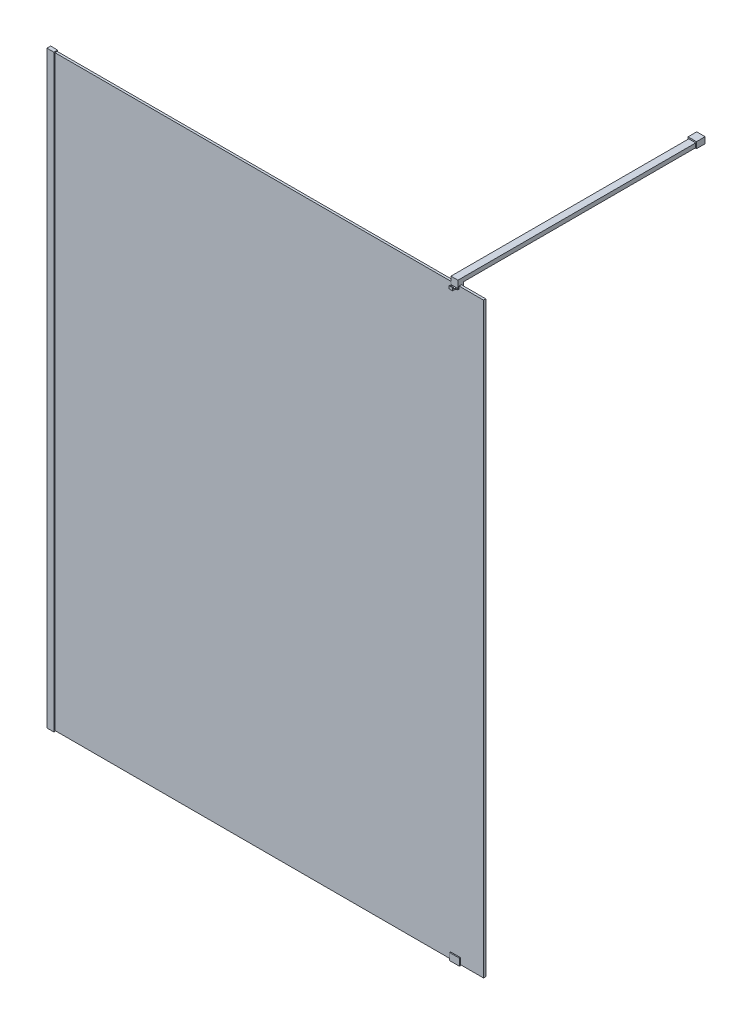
ISO-10303-21;
HEADER;
FILE_DESCRIPTION(('STEP AP214'),'2;1');
FILE_NAME('part.step','',(''),(''),'','','');
FILE_SCHEMA(('AUTOMOTIVE_DESIGN { 1 0 10303 214 1 1 1 1 }'));
ENDSEC;
DATA;
#1=APPLICATION_CONTEXT('core data for automotive mechanical design processes');
#2=APPLICATION_PROTOCOL_DEFINITION('international standard','automotive_design',2000,#1);
#3=PRODUCT_CONTEXT('',#1,'mechanical');
#4=PRODUCT('Part','Part','',(#3));
#5=PRODUCT_RELATED_PRODUCT_CATEGORY('part','',(#4));
#6=PRODUCT_DEFINITION_FORMATION('','',#4);
#7=PRODUCT_DEFINITION_CONTEXT('part definition',#1,'design');
#8=PRODUCT_DEFINITION('design','',#6,#7);
#9=PRODUCT_DEFINITION_SHAPE('','',#8);
#10=(LENGTH_UNIT() NAMED_UNIT(*) SI_UNIT(.MILLI.,.METRE.));
#11=(NAMED_UNIT(*) PLANE_ANGLE_UNIT() SI_UNIT($,.RADIAN.));
#12=(NAMED_UNIT(*) SI_UNIT($,.STERADIAN.) SOLID_ANGLE_UNIT());
#13=UNCERTAINTY_MEASURE_WITH_UNIT(LENGTH_MEASURE(1.E-05),#10,'distance_accuracy_value','');
#14=(GEOMETRIC_REPRESENTATION_CONTEXT(3) GLOBAL_UNCERTAINTY_ASSIGNED_CONTEXT((#13)) GLOBAL_UNIT_ASSIGNED_CONTEXT((#10,
#11,#12)) REPRESENTATION_CONTEXT('',''));
#15=CARTESIAN_POINT('',(0.,0.,0.));
#16=DIRECTION('',(0.,0.,1.));
#17=DIRECTION('',(1.,0.,0.));
#18=AXIS2_PLACEMENT_3D('',#15,#16,#17);
#19=CARTESIAN_POINT('',(1470.95,2090.,-19.4000000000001));
#20=DIRECTION('',(-1.,0.,0.));
#21=DIRECTION('',(0.,0.,1.));
#22=AXIS2_PLACEMENT_3D('',#19,#20,#21);
#23=PLANE('',#22);
#24=DIRECTION('',(0.,-1.,0.));
#25=VECTOR('',#24,1.);
#26=CARTESIAN_POINT('',(1470.95,2090.,-850.03));
#27=LINE('',#26,#25);
#28=CARTESIAN_POINT('',(1470.95,2120.,-850.03));
#29=VERTEX_POINT('',#28);
#30=CARTESIAN_POINT('',(1470.95,2105.,-850.03));
#31=VERTEX_POINT('',#30);
#32=EDGE_CURVE('E61',#29,#31,#27,.T.);
#33=ORIENTED_EDGE('',*,*,#32,.F.);
#34=DIRECTION('',(0.,0.,1.));
#35=VECTOR('',#34,1.);
#36=CARTESIAN_POINT('',(1470.95,2120.,0.599999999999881));
#37=LINE('',#36,#35);
#38=CARTESIAN_POINT('',(1470.95,2120.,0.599999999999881));
#39=VERTEX_POINT('',#38);
#40=EDGE_CURVE('E386',#29,#39,#37,.T.);
#41=ORIENTED_EDGE('',*,*,#40,.T.);
#42=DIRECTION('',(0.,-1.,0.));
#43=VECTOR('',#42,1.);
#44=CARTESIAN_POINT('',(1470.95,2094.,0.599999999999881));
#45=LINE('',#44,#43);
#46=CARTESIAN_POINT('',(1470.95,2094.,0.599999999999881));
#47=VERTEX_POINT('',#46);
#48=EDGE_CURVE('E388',#39,#47,#45,.T.);
#49=ORIENTED_EDGE('',*,*,#48,.T.);
#50=DIRECTION('',(0.,1.,0.));
#51=VECTOR('',#50,1.);
#52=CARTESIAN_POINT('',(1470.95,2090.,0.599999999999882));
#53=LINE('',#52,#51);
#54=CARTESIAN_POINT('',(1470.95,2090.,0.599999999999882));
#55=VERTEX_POINT('',#54);
#56=EDGE_CURVE('E332',#55,#47,#53,.T.);
#57=ORIENTED_EDGE('',*,*,#56,.F.);
#58=DIRECTION('',(0.,0.,-1.));
#59=VECTOR('',#58,1.);
#60=CARTESIAN_POINT('',(1470.95,2090.,-3.40000000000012));
#61=LINE('',#60,#59);
#62=CARTESIAN_POINT('',(1470.95,2090.,-3.40000000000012));
#63=VERTEX_POINT('',#62);
#64=EDGE_CURVE('E362',#55,#63,#61,.T.);
#65=ORIENTED_EDGE('',*,*,#64,.T.);
#66=DIRECTION('',(0.,1.,-1.30407837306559E-13));
#67=VECTOR('',#66,1.);
#68=CARTESIAN_POINT('',(1470.95,2100.,-3.40000000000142));
#69=LINE('',#68,#67);
#70=CARTESIAN_POINT('',(1470.95,2100.,-3.40000000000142));
#71=VERTEX_POINT('',#70);
#72=EDGE_CURVE('E392',#63,#71,#69,.T.);
#73=ORIENTED_EDGE('',*,*,#72,.T.);
#74=DIRECTION('',(0.,0.,-1.));
#75=VECTOR('',#74,1.);
#76=CARTESIAN_POINT('',(1470.95,2100.,-11.4000000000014));
#77=LINE('',#76,#75);
#78=CARTESIAN_POINT('',(1470.95,2100.,-11.4000000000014));
#79=VERTEX_POINT('',#78);
#80=EDGE_CURVE('E394',#71,#79,#77,.T.);
#81=ORIENTED_EDGE('',*,*,#80,.T.);
#82=DIRECTION('',(0.,-1.,1.30451205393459E-13));
#83=VECTOR('',#82,1.);
#84=CARTESIAN_POINT('',(1470.95,2090.,-11.4000000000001));
#85=LINE('',#84,#83);
#86=CARTESIAN_POINT('',(1470.95,2090.,-11.4000000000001));
#87=VERTEX_POINT('',#86);
#88=EDGE_CURVE('E395',#79,#87,#85,.T.);
#89=ORIENTED_EDGE('',*,*,#88,.T.);
#90=DIRECTION('',(0.,0.,-1.));
#91=VECTOR('',#90,1.);
#92=CARTESIAN_POINT('',(1470.95,2090.,-19.4000000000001));
#93=LINE('',#92,#91);
#94=CARTESIAN_POINT('',(1470.95,2090.,-19.4000000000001));
#95=VERTEX_POINT('',#94);
#96=EDGE_CURVE('E283',#87,#95,#93,.T.);
#97=ORIENTED_EDGE('',*,*,#96,.T.);
#98=DIRECTION('',(0.,1.,0.));
#99=VECTOR('',#98,1.);
#100=CARTESIAN_POINT('',(1470.95,2120.,-19.4000000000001));
#101=LINE('',#100,#99);
#102=CARTESIAN_POINT('',(1470.95,2105.,-19.4000000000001));
#103=VERTEX_POINT('',#102);
#104=EDGE_CURVE('E249',#95,#103,#101,.T.);
#105=ORIENTED_EDGE('',*,*,#104,.T.);
#106=DIRECTION('',(0.,0.,-1.));
#107=VECTOR('',#106,1.);
#108=CARTESIAN_POINT('',(1470.95,2105.,-881.03));
#109=LINE('',#108,#107);
#110=EDGE_CURVE('E248',#103,#31,#109,.T.);
#111=ORIENTED_EDGE('',*,*,#110,.T.);
#112=EDGE_LOOP('',(#33,#41,#49,#57,#65,#73,#81,#89,#97,#105,#111));
#113=FACE_BOUND('',#112,.T.);
#114=ADVANCED_FACE('F46',(#113),#23,.F.);
#115=CARTESIAN_POINT('',(1445.95,2090.,-19.4000000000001));
#116=DIRECTION('',(-1.,0.,0.));
#117=DIRECTION('',(0.,0.,1.));
#118=AXIS2_PLACEMENT_3D('',#115,#116,#117);
#119=PLANE('',#118);
#120=DIRECTION('',(0.,0.,1.));
#121=VECTOR('',#120,1.);
#122=CARTESIAN_POINT('',(1445.95,2120.,0.599999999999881));
#123=LINE('',#122,#121);
#124=CARTESIAN_POINT('',(1445.95,2120.,-850.03));
#125=VERTEX_POINT('',#124);
#126=CARTESIAN_POINT('',(1445.95,2120.,0.599999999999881));
#127=VERTEX_POINT('',#126);
#128=EDGE_CURVE('E272',#125,#127,#123,.T.);
#129=ORIENTED_EDGE('',*,*,#128,.F.);
#130=DIRECTION('',(0.,-1.,0.));
#131=VECTOR('',#130,1.);
#132=CARTESIAN_POINT('',(1445.95,2090.,-850.03));
#133=LINE('',#132,#131);
#134=CARTESIAN_POINT('',(1445.95,2105.,-850.03));
#135=VERTEX_POINT('',#134);
#136=EDGE_CURVE('E230',#125,#135,#133,.T.);
#137=ORIENTED_EDGE('',*,*,#136,.T.);
#138=DIRECTION('',(0.,0.,1.));
#139=VECTOR('',#138,1.);
#140=CARTESIAN_POINT('',(1445.95,2105.,-881.03));
#141=LINE('',#140,#139);
#142=CARTESIAN_POINT('',(1445.95,2105.,-19.4000000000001));
#143=VERTEX_POINT('',#142);
#144=EDGE_CURVE('E238',#135,#143,#141,.T.);
#145=ORIENTED_EDGE('',*,*,#144,.T.);
#146=DIRECTION('',(0.,1.,0.));
#147=VECTOR('',#146,1.);
#148=CARTESIAN_POINT('',(1445.95,2120.,-19.4000000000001));
#149=LINE('',#148,#147);
#150=CARTESIAN_POINT('',(1445.95,2090.,-19.4000000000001));
#151=VERTEX_POINT('',#150);
#152=EDGE_CURVE('E262',#151,#143,#149,.T.);
#153=ORIENTED_EDGE('',*,*,#152,.F.);
#154=DIRECTION('',(0.,0.,-1.));
#155=VECTOR('',#154,1.);
#156=CARTESIAN_POINT('',(1445.95,2090.,-19.4000000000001));
#157=LINE('',#156,#155);
#158=CARTESIAN_POINT('',(1445.95,2090.,-11.4000000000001));
#159=VERTEX_POINT('',#158);
#160=EDGE_CURVE('E296',#159,#151,#157,.T.);
#161=ORIENTED_EDGE('',*,*,#160,.F.);
#162=DIRECTION('',(0.,-1.,1.30451205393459E-13));
#163=VECTOR('',#162,1.);
#164=CARTESIAN_POINT('',(1445.95,2090.,-11.4000000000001));
#165=LINE('',#164,#163);
#166=CARTESIAN_POINT('',(1445.95,2100.,-11.4000000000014));
#167=VERTEX_POINT('',#166);
#168=EDGE_CURVE('E294',#167,#159,#165,.T.);
#169=ORIENTED_EDGE('',*,*,#168,.F.);
#170=DIRECTION('',(0.,0.,-1.));
#171=VECTOR('',#170,1.);
#172=CARTESIAN_POINT('',(1445.95,2100.,-11.4000000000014));
#173=LINE('',#172,#171);
#174=CARTESIAN_POINT('',(1445.95,2100.,-3.40000000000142));
#175=VERTEX_POINT('',#174);
#176=EDGE_CURVE('E292',#175,#167,#173,.T.);
#177=ORIENTED_EDGE('',*,*,#176,.F.);
#178=DIRECTION('',(0.,1.,-1.30407837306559E-13));
#179=VECTOR('',#178,1.);
#180=CARTESIAN_POINT('',(1445.95,2100.,-3.40000000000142));
#181=LINE('',#180,#179);
#182=CARTESIAN_POINT('',(1445.95,2090.,-3.40000000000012));
#183=VERTEX_POINT('',#182);
#184=EDGE_CURVE('E290',#183,#175,#181,.T.);
#185=ORIENTED_EDGE('',*,*,#184,.F.);
#186=DIRECTION('',(0.,0.,-1.));
#187=VECTOR('',#186,1.);
#188=CARTESIAN_POINT('',(1445.95,2090.,-3.40000000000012));
#189=LINE('',#188,#187);
#190=CARTESIAN_POINT('',(1445.95,2090.,0.599999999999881));
#191=VERTEX_POINT('',#190);
#192=EDGE_CURVE('E288',#191,#183,#189,.T.);
#193=ORIENTED_EDGE('',*,*,#192,.F.);
#194=DIRECTION('',(0.,1.,0.));
#195=VECTOR('',#194,1.);
#196=CARTESIAN_POINT('',(1445.95,2090.,0.599999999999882));
#197=LINE('',#196,#195);
#198=CARTESIAN_POINT('',(1445.95,2094.,0.599999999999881));
#199=VERTEX_POINT('',#198);
#200=EDGE_CURVE('E329',#191,#199,#197,.T.);
#201=ORIENTED_EDGE('',*,*,#200,.T.);
#202=DIRECTION('',(0.,-1.,0.));
#203=VECTOR('',#202,1.);
#204=CARTESIAN_POINT('',(1445.95,2094.,0.599999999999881));
#205=LINE('',#204,#203);
#206=EDGE_CURVE('E274',#127,#199,#205,.T.);
#207=ORIENTED_EDGE('',*,*,#206,.F.);
#208=EDGE_LOOP('',(#129,#137,#145,#153,#161,#169,#177,#185,#193,#201,#207));
#209=FACE_BOUND('',#208,.T.);
#210=ADVANCED_FACE('F259',(#209),#119,.T.);
#211=CARTESIAN_POINT('',(1470.95,2120.,0.599999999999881));
#212=DIRECTION('',(0.,-1.,0.));
#213=DIRECTION('',(0.,0.,-1.));
#214=AXIS2_PLACEMENT_3D('',#211,#212,#213);
#215=PLANE('',#214);
#216=DIRECTION('',(1.,0.,0.));
#217=VECTOR('',#216,1.);
#218=CARTESIAN_POINT('',(1470.95,2120.,-850.03));
#219=LINE('',#218,#217);
#220=EDGE_CURVE('E68',#125,#29,#219,.T.);
#221=ORIENTED_EDGE('',*,*,#220,.F.);
#222=ORIENTED_EDGE('',*,*,#128,.T.);
#223=DIRECTION('',(-1.,0.,0.));
#224=VECTOR('',#223,1.);
#225=CARTESIAN_POINT('',(1470.95,2120.,0.599999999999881));
#226=LINE('',#225,#224);
#227=EDGE_CURVE('E326',#39,#127,#226,.T.);
#228=ORIENTED_EDGE('',*,*,#227,.F.);
#229=ORIENTED_EDGE('',*,*,#40,.F.);
#230=EDGE_LOOP('',(#221,#222,#228,#229));
#231=FACE_BOUND('',#230,.T.);
#232=ADVANCED_FACE('F437',(#231),#215,.F.);
#233=CARTESIAN_POINT('',(1445.95,2105.,-19.4000000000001));
#234=DIRECTION('',(0.,1.,0.));
#235=DIRECTION('',(0.,0.,1.));
#236=AXIS2_PLACEMENT_3D('',#233,#234,#235);
#237=PLANE('',#236);
#238=DIRECTION('',(-1.,0.,0.));
#239=VECTOR('',#238,1.);
#240=CARTESIAN_POINT('',(1445.95,2105.,-850.03));
#241=LINE('',#240,#239);
#242=EDGE_CURVE('E12',#31,#135,#241,.T.);
#243=ORIENTED_EDGE('',*,*,#242,.F.);
#244=ORIENTED_EDGE('',*,*,#110,.F.);
#245=DIRECTION('',(1.,0.,0.));
#246=VECTOR('',#245,1.);
#247=CARTESIAN_POINT('',(1445.95,2105.,-19.4000000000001));
#248=LINE('',#247,#246);
#249=EDGE_CURVE('E244',#143,#103,#248,.T.);
#250=ORIENTED_EDGE('',*,*,#249,.F.);
#251=ORIENTED_EDGE('',*,*,#144,.F.);
#252=EDGE_LOOP('',(#243,#244,#250,#251));
#253=FACE_BOUND('',#252,.T.);
#254=ADVANCED_FACE('F265',(#253),#237,.F.);
#255=CARTESIAN_POINT('',(1470.95,2094.,9.84506801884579));
#256=DIRECTION('',(0.,-1.,0.));
#257=DIRECTION('',(0.,0.,-1.));
#258=AXIS2_PLACEMENT_3D('',#255,#256,#257);
#259=PLANE('',#258);
#260=DIRECTION('',(-0.906307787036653,0.,-0.422618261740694));
#261=VECTOR('',#260,1.);
#262=CARTESIAN_POINT('',(1470.02591161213,2094.,11.8267819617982));
#263=LINE('',#262,#261);
#264=CARTESIAN_POINT('',(1452.45,2094.,3.6309997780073));
#265=VERTEX_POINT('',#264);
#266=EDGE_CURVE('E365',#265,#199,#263,.T.);
#267=ORIENTED_EDGE('',*,*,#266,.F.);
#268=DIRECTION('',(0.,0.,-1.));
#269=VECTOR('',#268,1.);
#270=CARTESIAN_POINT('',(1452.45,2094.,9.84506801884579));
#271=LINE('',#270,#269);
#272=CARTESIAN_POINT('',(1452.45,2094.,9.84506801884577));
#273=VERTEX_POINT('',#272);
#274=EDGE_CURVE('E273',#273,#265,#271,.T.);
#275=ORIENTED_EDGE('',*,*,#274,.F.);
#276=DIRECTION('',(-1.,0.,0.));
#277=VECTOR('',#276,1.);
#278=CARTESIAN_POINT('',(1470.95,2094.,9.84506801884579));
#279=LINE('',#278,#277);
#280=CARTESIAN_POINT('',(1464.45,2094.,9.84506801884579));
#281=VERTEX_POINT('',#280);
#282=EDGE_CURVE('E320',#281,#273,#279,.T.);
#283=ORIENTED_EDGE('',*,*,#282,.F.);
#284=DIRECTION('',(0.,0.,1.));
#285=VECTOR('',#284,1.);
#286=CARTESIAN_POINT('',(1464.45,2094.,9.84506801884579));
#287=LINE('',#286,#285);
#288=CARTESIAN_POINT('',(1464.45,2094.,3.63099977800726));
#289=VERTEX_POINT('',#288);
#290=EDGE_CURVE('E379',#289,#281,#287,.T.);
#291=ORIENTED_EDGE('',*,*,#290,.F.);
#292=DIRECTION('',(-0.906307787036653,0.,0.422618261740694));
#293=VECTOR('',#292,1.);
#294=CARTESIAN_POINT('',(1467.40893350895,2094.,2.25122642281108));
#295=LINE('',#294,#293);
#296=EDGE_CURVE('E364',#47,#289,#295,.T.);
#297=ORIENTED_EDGE('',*,*,#296,.F.);
#298=DIRECTION('',(-1.,0.,0.));
#299=VECTOR('',#298,1.);
#300=CARTESIAN_POINT('',(1470.95,2094.,0.599999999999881));
#301=LINE('',#300,#299);
#302=EDGE_CURVE('E323',#47,#199,#301,.T.);
#303=ORIENTED_EDGE('',*,*,#302,.T.);
#304=EDGE_LOOP('',(#267,#275,#283,#291,#297,#303));
#305=FACE_BOUND('',#304,.T.);
#306=ADVANCED_FACE('F424',(#305),#259,.F.);
#307=CARTESIAN_POINT('',(1470.95,2100.,10.3700000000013));
#308=DIRECTION('',(0.,-0.087155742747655,0.996194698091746));
#309=DIRECTION('',(0.,-0.996194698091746,-0.087155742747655));
#310=AXIS2_PLACEMENT_3D('',#307,#308,#309);
#311=PLANE('',#310);
#312=DIRECTION('',(0.,-0.996194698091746,-0.087155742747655));
#313=VECTOR('',#312,1.);
#314=CARTESIAN_POINT('',(1452.45,2100.,10.3700000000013));
#315=LINE('',#314,#313);
#316=CARTESIAN_POINT('',(1452.45,2100.,10.3700000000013));
#317=VERTEX_POINT('',#316);
#318=EDGE_CURVE('E276',#317,#273,#315,.T.);
#319=ORIENTED_EDGE('',*,*,#318,.F.);
#320=DIRECTION('',(-1.,0.,0.));
#321=VECTOR('',#320,1.);
#322=CARTESIAN_POINT('',(1470.95,2100.,10.3700000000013));
#323=LINE('',#322,#321);
#324=CARTESIAN_POINT('',(1464.45,2100.,10.3700000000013));
#325=VERTEX_POINT('',#324);
#326=EDGE_CURVE('E317',#325,#317,#323,.T.);
#327=ORIENTED_EDGE('',*,*,#326,.F.);
#328=DIRECTION('',(0.,0.996194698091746,0.087155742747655));
#329=VECTOR('',#328,1.);
#330=CARTESIAN_POINT('',(1464.45,2100.,10.3700000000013));
#331=LINE('',#330,#329);
#332=EDGE_CURVE('E376',#281,#325,#331,.T.);
#333=ORIENTED_EDGE('',*,*,#332,.F.);
#334=ORIENTED_EDGE('',*,*,#282,.T.);
#335=EDGE_LOOP('',(#319,#327,#333,#334));
#336=FACE_BOUND('',#335,.T.);
#337=ADVANCED_FACE('F428',(#336),#311,.F.);
#338=CARTESIAN_POINT('',(1470.95,2100.,13.3700000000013));
#339=DIRECTION('',(0.,-1.,1.48029736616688E-13));
#340=DIRECTION('',(0.,-1.48029736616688E-13,-1.));
#341=AXIS2_PLACEMENT_3D('',#338,#339,#340);
#342=PLANE('',#341);
#343=DIRECTION('',(0.,-1.48029736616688E-13,-1.));
#344=VECTOR('',#343,1.);
#345=CARTESIAN_POINT('',(1452.45,2100.,13.3700000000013));
#346=LINE('',#345,#344);
#347=CARTESIAN_POINT('',(1452.45,2100.,13.3700000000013));
#348=VERTEX_POINT('',#347);
#349=EDGE_CURVE('E382',#348,#317,#346,.T.);
#350=ORIENTED_EDGE('',*,*,#349,.F.);
#351=DIRECTION('',(-1.,0.,0.));
#352=VECTOR('',#351,1.);
#353=CARTESIAN_POINT('',(1470.95,2100.,13.3700000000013));
#354=LINE('',#353,#352);
#355=CARTESIAN_POINT('',(1464.45,2100.,13.3700000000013));
#356=VERTEX_POINT('',#355);
#357=EDGE_CURVE('E314',#356,#348,#354,.T.);
#358=ORIENTED_EDGE('',*,*,#357,.F.);
#359=DIRECTION('',(0.,1.48029736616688E-13,1.));
#360=VECTOR('',#359,1.);
#361=CARTESIAN_POINT('',(1464.45,2100.,13.3700000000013));
#362=LINE('',#361,#360);
#363=EDGE_CURVE('E368',#325,#356,#362,.T.);
#364=ORIENTED_EDGE('',*,*,#363,.F.);
#365=ORIENTED_EDGE('',*,*,#326,.T.);
#366=EDGE_LOOP('',(#350,#358,#364,#365));
#367=FACE_BOUND('',#366,.T.);
#368=ADVANCED_FACE('F431',(#367),#342,.F.);
#369=CARTESIAN_POINT('',(1470.95,2090.,13.3700000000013));
#370=DIRECTION('',(0.,0.,-1.));
#371=DIRECTION('',(0.,1.,0.));
#372=AXIS2_PLACEMENT_3D('',#369,#370,#371);
#373=PLANE('',#372);
#374=ORIENTED_EDGE('',*,*,#357,.T.);
#375=DIRECTION('',(0.,-1.,0.));
#376=VECTOR('',#375,1.);
#377=CARTESIAN_POINT('',(1452.45,8021.01585998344,13.3700000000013));
#378=LINE('',#377,#376);
#379=CARTESIAN_POINT('',(1452.45,2090.,13.3700000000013));
#380=VERTEX_POINT('',#379);
#381=EDGE_CURVE('E345',#348,#380,#378,.T.);
#382=ORIENTED_EDGE('',*,*,#381,.T.);
#383=DIRECTION('',(-1.,0.,0.));
#384=VECTOR('',#383,1.);
#385=CARTESIAN_POINT('',(1470.95,2090.,13.3700000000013));
#386=LINE('',#385,#384);
#387=CARTESIAN_POINT('',(1464.45,2090.,13.3700000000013));
#388=VERTEX_POINT('',#387);
#389=EDGE_CURVE('E311',#388,#380,#386,.T.);
#390=ORIENTED_EDGE('',*,*,#389,.F.);
#391=DIRECTION('',(0.,-1.,0.));
#392=VECTOR('',#391,1.);
#393=CARTESIAN_POINT('',(1464.45,8021.01585998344,13.3700000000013));
#394=LINE('',#393,#392);
#395=EDGE_CURVE('E355',#356,#388,#394,.T.);
#396=ORIENTED_EDGE('',*,*,#395,.F.);
#397=EDGE_LOOP('',(#374,#382,#390,#396));
#398=FACE_BOUND('',#397,.T.);
#399=ADVANCED_FACE('F353',(#398),#373,.F.);
#400=CARTESIAN_POINT('',(1470.95,2090.,-3.40000000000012));
#401=DIRECTION('',(0.,1.,0.));
#402=DIRECTION('',(0.,0.,1.));
#403=AXIS2_PLACEMENT_3D('',#400,#401,#402);
#404=PLANE('',#403);
#405=DIRECTION('',(0.906307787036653,0.,0.422618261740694));
#406=VECTOR('',#405,1.);
#407=CARTESIAN_POINT('',(1464.95275623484,2090.,9.46113075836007));
#408=LINE('',#407,#406);
#409=CARTESIAN_POINT('',(1452.45,2090.,3.6309997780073));
#410=VERTEX_POINT('',#409);
#411=EDGE_CURVE('E370',#191,#410,#408,.T.);
#412=ORIENTED_EDGE('',*,*,#411,.F.);
#413=ORIENTED_EDGE('',*,*,#192,.T.);
#414=DIRECTION('',(-1.,0.,0.));
#415=VECTOR('',#414,1.);
#416=CARTESIAN_POINT('',(1470.95,2090.,-3.40000000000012));
#417=LINE('',#416,#415);
#418=EDGE_CURVE('E308',#63,#183,#417,.T.);
#419=ORIENTED_EDGE('',*,*,#418,.F.);
#420=ORIENTED_EDGE('',*,*,#64,.F.);
#421=DIRECTION('',(0.906307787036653,0.,-0.422618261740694));
#422=VECTOR('',#421,1.);
#423=CARTESIAN_POINT('',(1472.48208888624,2090.,-0.114424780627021));
#424=LINE('',#423,#422);
#425=CARTESIAN_POINT('',(1464.45,2090.,3.6309997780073));
#426=VERTEX_POINT('',#425);
#427=EDGE_CURVE('E360',#426,#55,#424,.T.);
#428=ORIENTED_EDGE('',*,*,#427,.F.);
#429=DIRECTION('',(0.,0.,-1.));
#430=VECTOR('',#429,1.);
#431=CARTESIAN_POINT('',(1464.45,2090.,-3.40000000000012));
#432=LINE('',#431,#430);
#433=EDGE_CURVE('E334',#388,#426,#432,.T.);
#434=ORIENTED_EDGE('',*,*,#433,.F.);
#435=ORIENTED_EDGE('',*,*,#389,.T.);
#436=DIRECTION('',(0.,0.,1.));
#437=VECTOR('',#436,1.);
#438=CARTESIAN_POINT('',(1452.45,2090.,-3.40000000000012));
#439=LINE('',#438,#437);
#440=EDGE_CURVE('E54',#410,#380,#439,.T.);
#441=ORIENTED_EDGE('',*,*,#440,.F.);
#442=EDGE_LOOP('',(#412,#413,#419,#420,#428,#434,#435,#441));
#443=FACE_BOUND('',#442,.T.);
#444=ADVANCED_FACE('F357',(#443),#404,.F.);
#445=CARTESIAN_POINT('',(1470.95,2120.,-19.4000000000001));
#446=DIRECTION('',(0.,0.,1.));
#447=DIRECTION('',(0.,-1.,0.));
#448=AXIS2_PLACEMENT_3D('',#445,#446,#447);
#449=PLANE('',#448);
#450=ORIENTED_EDGE('',*,*,#152,.T.);
#451=ORIENTED_EDGE('',*,*,#249,.T.);
#452=ORIENTED_EDGE('',*,*,#104,.F.);
#453=DIRECTION('',(-1.,0.,0.));
#454=VECTOR('',#453,1.);
#455=CARTESIAN_POINT('',(1470.95,2090.,-19.4000000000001));
#456=LINE('',#455,#454);
#457=EDGE_CURVE('E271',#95,#151,#456,.T.);
#458=ORIENTED_EDGE('',*,*,#457,.T.);
#459=EDGE_LOOP('',(#450,#451,#452,#458));
#460=FACE_BOUND('',#459,.T.);
#461=ADVANCED_FACE('F48',(#460),#449,.F.);
#462=CARTESIAN_POINT('',(1470.95,2094.,0.599999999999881));
#463=DIRECTION('',(0.,0.,-1.));
#464=DIRECTION('',(0.,1.,0.));
#465=AXIS2_PLACEMENT_3D('',#462,#463,#464);
#466=PLANE('',#465);
#467=ORIENTED_EDGE('',*,*,#206,.T.);
#468=ORIENTED_EDGE('',*,*,#302,.F.);
#469=ORIENTED_EDGE('',*,*,#48,.F.);
#470=ORIENTED_EDGE('',*,*,#227,.T.);
#471=EDGE_LOOP('',(#467,#468,#469,#470));
#472=FACE_BOUND('',#471,.T.);
#473=ADVANCED_FACE('F435',(#472),#466,.F.);
#474=CARTESIAN_POINT('',(1470.95,2100.,-3.40000000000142));
#475=DIRECTION('',(0.,1.30407837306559E-13,1.));
#476=DIRECTION('',(0.,-1.,1.30407837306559E-13));
#477=AXIS2_PLACEMENT_3D('',#474,#475,#476);
#478=PLANE('',#477);
#479=ORIENTED_EDGE('',*,*,#184,.T.);
#480=DIRECTION('',(-1.,0.,0.));
#481=VECTOR('',#480,1.);
#482=CARTESIAN_POINT('',(1470.95,2100.,-3.40000000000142));
#483=LINE('',#482,#481);
#484=EDGE_CURVE('E305',#71,#175,#483,.T.);
#485=ORIENTED_EDGE('',*,*,#484,.F.);
#486=ORIENTED_EDGE('',*,*,#72,.F.);
#487=ORIENTED_EDGE('',*,*,#418,.T.);
#488=EDGE_LOOP('',(#479,#485,#486,#487));
#489=FACE_BOUND('',#488,.T.);
#490=ADVANCED_FACE('F413',(#489),#478,.F.);
#491=CARTESIAN_POINT('',(1470.95,2100.,-11.4000000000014));
#492=DIRECTION('',(0.,1.,0.));
#493=DIRECTION('',(0.,0.,1.));
#494=AXIS2_PLACEMENT_3D('',#491,#492,#493);
#495=PLANE('',#494);
#496=ORIENTED_EDGE('',*,*,#176,.T.);
#497=DIRECTION('',(-1.,0.,0.));
#498=VECTOR('',#497,1.);
#499=CARTESIAN_POINT('',(1470.95,2100.,-11.4000000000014));
#500=LINE('',#499,#498);
#501=EDGE_CURVE('E302',#79,#167,#500,.T.);
#502=ORIENTED_EDGE('',*,*,#501,.F.);
#503=ORIENTED_EDGE('',*,*,#80,.F.);
#504=ORIENTED_EDGE('',*,*,#484,.T.);
#505=EDGE_LOOP('',(#496,#502,#503,#504));
#506=FACE_BOUND('',#505,.T.);
#507=ADVANCED_FACE('F409',(#506),#495,.F.);
#508=CARTESIAN_POINT('',(1470.95,2090.,-11.4000000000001));
#509=DIRECTION('',(0.,-1.30451205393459E-13,-1.));
#510=DIRECTION('',(0.,1.,-1.30451205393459E-13));
#511=AXIS2_PLACEMENT_3D('',#508,#509,#510);
#512=PLANE('',#511);
#513=ORIENTED_EDGE('',*,*,#168,.T.);
#514=DIRECTION('',(-1.,0.,0.));
#515=VECTOR('',#514,1.);
#516=CARTESIAN_POINT('',(1470.95,2090.,-11.4000000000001));
#517=LINE('',#516,#515);
#518=EDGE_CURVE('E299',#87,#159,#517,.T.);
#519=ORIENTED_EDGE('',*,*,#518,.F.);
#520=ORIENTED_EDGE('',*,*,#88,.F.);
#521=ORIENTED_EDGE('',*,*,#501,.T.);
#522=EDGE_LOOP('',(#513,#519,#520,#521));
#523=FACE_BOUND('',#522,.T.);
#524=ADVANCED_FACE('F405',(#523),#512,.F.);
#525=CARTESIAN_POINT('',(1470.95,2090.,-19.4000000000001));
#526=DIRECTION('',(0.,1.,0.));
#527=DIRECTION('',(0.,0.,1.));
#528=AXIS2_PLACEMENT_3D('',#525,#526,#527);
#529=PLANE('',#528);
#530=ORIENTED_EDGE('',*,*,#160,.T.);
#531=ORIENTED_EDGE('',*,*,#457,.F.);
#532=ORIENTED_EDGE('',*,*,#96,.F.);
#533=ORIENTED_EDGE('',*,*,#518,.T.);
#534=EDGE_LOOP('',(#530,#531,#532,#533));
#535=FACE_BOUND('',#534,.T.);
#536=ADVANCED_FACE('F400',(#535),#529,.F.);
#537=CARTESIAN_POINT('',(1445.95,8021.01585998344,0.599999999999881));
#538=DIRECTION('',(-0.422618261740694,0.,0.906307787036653));
#539=DIRECTION('',(0.906307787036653,0.,0.422618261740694));
#540=AXIS2_PLACEMENT_3D('',#537,#538,#539);
#541=PLANE('',#540);
#542=DIRECTION('',(0.,-1.,0.));
#543=VECTOR('',#542,1.);
#544=CARTESIAN_POINT('',(1452.45,8021.01585998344,3.6309997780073));
#545=LINE('',#544,#543);
#546=EDGE_CURVE('E348',#265,#410,#545,.T.);
#547=ORIENTED_EDGE('',*,*,#546,.F.);
#548=ORIENTED_EDGE('',*,*,#266,.T.);
#549=ORIENTED_EDGE('',*,*,#200,.F.);
#550=ORIENTED_EDGE('',*,*,#411,.T.);
#551=EDGE_LOOP('',(#547,#548,#549,#550));
#552=FACE_BOUND('',#551,.T.);
#553=ADVANCED_FACE('F432',(#552),#541,.T.);
#554=CARTESIAN_POINT('',(1452.45,8021.01585998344,3.6309997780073));
#555=DIRECTION('',(-1.,0.,0.));
#556=DIRECTION('',(0.,0.,1.));
#557=AXIS2_PLACEMENT_3D('',#554,#555,#556);
#558=PLANE('',#557);
#559=ORIENTED_EDGE('',*,*,#318,.T.);
#560=ORIENTED_EDGE('',*,*,#274,.T.);
#561=ORIENTED_EDGE('',*,*,#546,.T.);
#562=ORIENTED_EDGE('',*,*,#440,.T.);
#563=ORIENTED_EDGE('',*,*,#381,.F.);
#564=ORIENTED_EDGE('',*,*,#349,.T.);
#565=EDGE_LOOP('',(#559,#560,#561,#562,#563,#564));
#566=FACE_BOUND('',#565,.T.);
#567=ADVANCED_FACE('F344',(#566),#558,.T.);
#568=CARTESIAN_POINT('',(1464.45,8021.01585998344,3.6309997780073));
#569=DIRECTION('',(1.,0.,0.));
#570=DIRECTION('',(0.,0.,-1.));
#571=AXIS2_PLACEMENT_3D('',#568,#569,#570);
#572=PLANE('',#571);
#573=DIRECTION('',(0.,-1.,0.));
#574=VECTOR('',#573,1.);
#575=CARTESIAN_POINT('',(1464.45,8021.01585998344,3.6309997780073));
#576=LINE('',#575,#574);
#577=EDGE_CURVE('E241',#289,#426,#576,.T.);
#578=ORIENTED_EDGE('',*,*,#577,.F.);
#579=ORIENTED_EDGE('',*,*,#290,.T.);
#580=ORIENTED_EDGE('',*,*,#332,.T.);
#581=ORIENTED_EDGE('',*,*,#363,.T.);
#582=ORIENTED_EDGE('',*,*,#395,.T.);
#583=ORIENTED_EDGE('',*,*,#433,.T.);
#584=EDGE_LOOP('',(#578,#579,#580,#581,#582,#583));
#585=FACE_BOUND('',#584,.T.);
#586=ADVANCED_FACE('F420',(#585),#572,.T.);
#587=CARTESIAN_POINT('',(1470.95,8021.01585998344,0.599999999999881));
#588=DIRECTION('',(0.422618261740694,0.,0.906307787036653));
#589=DIRECTION('',(0.906307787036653,0.,-0.422618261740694));
#590=AXIS2_PLACEMENT_3D('',#587,#588,#589);
#591=PLANE('',#590);
#592=ORIENTED_EDGE('',*,*,#56,.T.);
#593=ORIENTED_EDGE('',*,*,#296,.T.);
#594=ORIENTED_EDGE('',*,*,#577,.T.);
#595=ORIENTED_EDGE('',*,*,#427,.T.);
#596=EDGE_LOOP('',(#592,#593,#594,#595));
#597=FACE_BOUND('',#596,.T.);
#598=ADVANCED_FACE('F418',(#597),#591,.T.);
#599=CARTESIAN_POINT('',(1443.44999999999,2103.,-850.03));
#600=DIRECTION('',(0.,0.,-1.));
#601=DIRECTION('',(-1.,0.,0.));
#602=AXIS2_PLACEMENT_3D('',#599,#600,#601);
#603=PLANE('',#602);
#604=DIRECTION('',(0.,1.,0.));
#605=VECTOR('',#604,1.);
#606=CARTESIAN_POINT('',(1443.44999999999,2125.,-850.03));
#607=LINE('',#606,#605);
#608=CARTESIAN_POINT('',(1443.44999999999,2103.,-850.03));
#609=VERTEX_POINT('',#608);
#610=CARTESIAN_POINT('',(1443.44999999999,2125.,-850.03));
#611=VERTEX_POINT('',#610);
#612=EDGE_CURVE('E209',#609,#611,#607,.T.);
#613=ORIENTED_EDGE('',*,*,#612,.F.);
#614=DIRECTION('',(-1.,0.,0.));
#615=VECTOR('',#614,1.);
#616=CARTESIAN_POINT('',(1473.44999999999,2103.,-850.03));
#617=LINE('',#616,#615);
#618=CARTESIAN_POINT('',(1473.44999999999,2103.,-850.03));
#619=VERTEX_POINT('',#618);
#620=EDGE_CURVE('E201',#619,#609,#617,.T.);
#621=ORIENTED_EDGE('',*,*,#620,.F.);
#622=DIRECTION('',(0.,-1.,0.));
#623=VECTOR('',#622,1.);
#624=CARTESIAN_POINT('',(1473.44999999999,2125.,-850.03));
#625=LINE('',#624,#623);
#626=CARTESIAN_POINT('',(1473.44999999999,2125.,-850.03));
#627=VERTEX_POINT('',#626);
#628=EDGE_CURVE('E212',#627,#619,#625,.T.);
#629=ORIENTED_EDGE('',*,*,#628,.F.);
#630=DIRECTION('',(1.,0.,0.));
#631=VECTOR('',#630,1.);
#632=CARTESIAN_POINT('',(1473.44999999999,2125.,-850.03));
#633=LINE('',#632,#631);
#634=EDGE_CURVE('E193',#611,#627,#633,.T.);
#635=ORIENTED_EDGE('',*,*,#634,.F.);
#636=EDGE_LOOP('',(#613,#621,#629,#635));
#637=FACE_BOUND('',#636,.T.);
#638=ORIENTED_EDGE('',*,*,#136,.F.);
#639=ORIENTED_EDGE('',*,*,#220,.T.);
#640=ORIENTED_EDGE('',*,*,#32,.T.);
#641=ORIENTED_EDGE('',*,*,#242,.T.);
#642=EDGE_LOOP('',(#638,#639,#640,#641));
#643=FACE_BOUND('',#642,.T.);
#644=ADVANCED_FACE('F206',(#637,#643),#603,.F.);
#645=CARTESIAN_POINT('',(1443.44999999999,2125.,-850.03));
#646=DIRECTION('',(-1.,0.,0.));
#647=DIRECTION('',(0.,0.,1.));
#648=AXIS2_PLACEMENT_3D('',#645,#646,#647);
#649=PLANE('',#648);
#650=DIRECTION('',(0.,1.,0.));
#651=VECTOR('',#650,1.);
#652=CARTESIAN_POINT('',(1443.44999999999,2125.,-881.03));
#653=LINE('',#652,#651);
#654=CARTESIAN_POINT('',(1443.44999999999,2103.,-881.03));
#655=VERTEX_POINT('',#654);
#656=CARTESIAN_POINT('',(1443.44999999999,2125.,-881.03));
#657=VERTEX_POINT('',#656);
#658=EDGE_CURVE('E224',#655,#657,#653,.T.);
#659=ORIENTED_EDGE('',*,*,#658,.F.);
#660=DIRECTION('',(0.,0.,-1.));
#661=VECTOR('',#660,1.);
#662=CARTESIAN_POINT('',(1443.44999999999,2103.,-850.03));
#663=LINE('',#662,#661);
#664=EDGE_CURVE('E215',#609,#655,#663,.T.);
#665=ORIENTED_EDGE('',*,*,#664,.F.);
#666=ORIENTED_EDGE('',*,*,#612,.T.);
#667=DIRECTION('',(0.,0.,-1.));
#668=VECTOR('',#667,1.);
#669=CARTESIAN_POINT('',(1443.44999999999,2125.,-850.03));
#670=LINE('',#669,#668);
#671=EDGE_CURVE('E190',#611,#657,#670,.T.);
#672=ORIENTED_EDGE('',*,*,#671,.T.);
#673=EDGE_LOOP('',(#659,#665,#666,#672));
#674=FACE_BOUND('',#673,.T.);
#675=ADVANCED_FACE('F214',(#674),#649,.T.);
#676=CARTESIAN_POINT('',(1473.44999999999,2103.,-850.03));
#677=DIRECTION('',(0.,-1.,0.));
#678=DIRECTION('',(0.,0.,-1.));
#679=AXIS2_PLACEMENT_3D('',#676,#677,#678);
#680=PLANE('',#679);
#681=DIRECTION('',(-1.,0.,0.));
#682=VECTOR('',#681,1.);
#683=CARTESIAN_POINT('',(1473.44999999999,2103.,-881.03));
#684=LINE('',#683,#682);
#685=CARTESIAN_POINT('',(1473.44999999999,2103.,-881.03));
#686=VERTEX_POINT('',#685);
#687=EDGE_CURVE('E216',#686,#655,#684,.T.);
#688=ORIENTED_EDGE('',*,*,#687,.F.);
#689=DIRECTION('',(0.,0.,-1.));
#690=VECTOR('',#689,1.);
#691=CARTESIAN_POINT('',(1473.44999999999,2103.,-850.03));
#692=LINE('',#691,#690);
#693=EDGE_CURVE('E231',#619,#686,#692,.T.);
#694=ORIENTED_EDGE('',*,*,#693,.F.);
#695=ORIENTED_EDGE('',*,*,#620,.T.);
#696=ORIENTED_EDGE('',*,*,#664,.T.);
#697=EDGE_LOOP('',(#688,#694,#695,#696));
#698=FACE_BOUND('',#697,.T.);
#699=ADVANCED_FACE('F444',(#698),#680,.T.);
#700=CARTESIAN_POINT('',(1473.44999999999,2125.,-850.03));
#701=DIRECTION('',(1.,0.,0.));
#702=DIRECTION('',(0.,1.,0.));
#703=AXIS2_PLACEMENT_3D('',#700,#701,#702);
#704=PLANE('',#703);
#705=DIRECTION('',(0.,-1.,0.));
#706=VECTOR('',#705,1.);
#707=CARTESIAN_POINT('',(1473.44999999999,2125.,-881.03));
#708=LINE('',#707,#706);
#709=CARTESIAN_POINT('',(1473.44999999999,2125.,-881.03));
#710=VERTEX_POINT('',#709);
#711=EDGE_CURVE('E219',#710,#686,#708,.T.);
#712=ORIENTED_EDGE('',*,*,#711,.F.);
#713=DIRECTION('',(0.,0.,-1.));
#714=VECTOR('',#713,1.);
#715=CARTESIAN_POINT('',(1473.44999999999,2125.,-850.03));
#716=LINE('',#715,#714);
#717=EDGE_CURVE('E200',#627,#710,#716,.T.);
#718=ORIENTED_EDGE('',*,*,#717,.F.);
#719=ORIENTED_EDGE('',*,*,#628,.T.);
#720=ORIENTED_EDGE('',*,*,#693,.T.);
#721=EDGE_LOOP('',(#712,#718,#719,#720));
#722=FACE_BOUND('',#721,.T.);
#723=ADVANCED_FACE('F612',(#722),#704,.T.);
#724=CARTESIAN_POINT('',(1473.44999999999,2125.,-850.03));
#725=DIRECTION('',(0.,1.,0.));
#726=DIRECTION('',(0.,0.,1.));
#727=AXIS2_PLACEMENT_3D('',#724,#725,#726);
#728=PLANE('',#727);
#729=DIRECTION('',(1.,0.,0.));
#730=VECTOR('',#729,1.);
#731=CARTESIAN_POINT('',(1473.44999999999,2125.,-881.03));
#732=LINE('',#731,#730);
#733=EDGE_CURVE('E195',#657,#710,#732,.T.);
#734=ORIENTED_EDGE('',*,*,#733,.F.);
#735=ORIENTED_EDGE('',*,*,#671,.F.);
#736=ORIENTED_EDGE('',*,*,#634,.T.);
#737=ORIENTED_EDGE('',*,*,#717,.T.);
#738=EDGE_LOOP('',(#734,#735,#736,#737));
#739=FACE_BOUND('',#738,.T.);
#740=ADVANCED_FACE('F192',(#739),#728,.T.);
#741=CARTESIAN_POINT('',(1445.95,2105.,-881.03));
#742=DIRECTION('',(0.,0.,-1.));
#743=DIRECTION('',(-1.,0.,0.));
#744=AXIS2_PLACEMENT_3D('',#741,#742,#743);
#745=PLANE('',#744);
#746=ORIENTED_EDGE('',*,*,#658,.T.);
#747=ORIENTED_EDGE('',*,*,#733,.T.);
#748=ORIENTED_EDGE('',*,*,#711,.T.);
#749=ORIENTED_EDGE('',*,*,#687,.T.);
#750=EDGE_LOOP('',(#746,#747,#748,#749));
#751=FACE_BOUND('',#750,.T.);
#752=ADVANCED_FACE('F485',(#751),#745,.T.);
#753=CLOSED_SHELL('',(#114,#210,#232,#254,#306,#337,#368,#399,#444,#461,#473,#490,#507,#524,
#536,#553,#567,#586,#598,#644,#675,#699,#723,#740,#752));
#754=MANIFOLD_SOLID_BREP('B2',#753);
#755=CARTESIAN_POINT('',(1475.95,22.,-11.4000000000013));
#756=DIRECTION('',(0.,0.,-1.));
#757=DIRECTION('',(0.,1.,0.));
#758=AXIS2_PLACEMENT_3D('',#755,#756,#757);
#759=PLANE('',#758);
#760=DIRECTION('',(0.,-1.,0.));
#761=VECTOR('',#760,1.);
#762=CARTESIAN_POINT('',(1440.95,22.,-11.4000000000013));
#763=LINE('',#762,#761);
#764=CARTESIAN_POINT('',(1440.95,22.,-11.4000000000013));
#765=VERTEX_POINT('',#764);
#766=CARTESIAN_POINT('',(1440.95,0.,-11.4));
#767=VERTEX_POINT('',#766);
#768=EDGE_CURVE('E765',#765,#767,#763,.T.);
#769=ORIENTED_EDGE('',*,*,#768,.T.);
#770=DIRECTION('',(-1.,0.,0.));
#771=VECTOR('',#770,1.);
#772=CARTESIAN_POINT('',(1475.95,0.,-11.4));
#773=LINE('',#772,#771);
#774=CARTESIAN_POINT('',(1475.95,0.,-11.4));
#775=VERTEX_POINT('',#774);
#776=EDGE_CURVE('E44',#775,#767,#773,.T.);
#777=ORIENTED_EDGE('',*,*,#776,.F.);
#778=DIRECTION('',(0.,-1.,0.));
#779=VECTOR('',#778,1.);
#780=CARTESIAN_POINT('',(1475.95,22.,-11.4000000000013));
#781=LINE('',#780,#779);
#782=CARTESIAN_POINT('',(1475.95,22.,-11.4000000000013));
#783=VERTEX_POINT('',#782);
#784=EDGE_CURVE('E779',#783,#775,#781,.T.);
#785=ORIENTED_EDGE('',*,*,#784,.F.);
#786=DIRECTION('',(-1.,0.,0.));
#787=VECTOR('',#786,1.);
#788=CARTESIAN_POINT('',(1475.95,22.,-11.4000000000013));
#789=LINE('',#788,#787);
#790=EDGE_CURVE('E761',#783,#765,#789,.T.);
#791=ORIENTED_EDGE('',*,*,#790,.T.);
#792=EDGE_LOOP('',(#769,#777,#785,#791));
#793=FACE_BOUND('',#792,.T.);
#794=ADVANCED_FACE('F669',(#793),#759,.F.);
#795=CARTESIAN_POINT('',(1475.95,0.,-11.4));
#796=DIRECTION('',(0.,-1.,0.));
#797=DIRECTION('',(0.,0.,-1.));
#798=AXIS2_PLACEMENT_3D('',#795,#796,#797);
#799=PLANE('',#798);
#800=DIRECTION('',(0.,0.,1.));
#801=VECTOR('',#800,1.);
#802=CARTESIAN_POINT('',(1440.95,0.,-11.4));
#803=LINE('',#802,#801);
#804=CARTESIAN_POINT('',(1440.95,0.,-3.4));
#805=VERTEX_POINT('',#804);
#806=EDGE_CURVE('E768',#767,#805,#803,.T.);
#807=ORIENTED_EDGE('',*,*,#806,.T.);
#808=DIRECTION('',(-1.,0.,0.));
#809=VECTOR('',#808,1.);
#810=CARTESIAN_POINT('',(1475.95,0.,-3.4));
#811=LINE('',#810,#809);
#812=CARTESIAN_POINT('',(1475.95,0.,-3.4));
#813=VERTEX_POINT('',#812);
#814=EDGE_CURVE('E677',#813,#805,#811,.T.);
#815=ORIENTED_EDGE('',*,*,#814,.F.);
#816=DIRECTION('',(0.,0.,1.));
#817=VECTOR('',#816,1.);
#818=CARTESIAN_POINT('',(1475.95,0.,-11.4));
#819=LINE('',#818,#817);
#820=EDGE_CURVE('E728',#775,#813,#819,.T.);
#821=ORIENTED_EDGE('',*,*,#820,.F.);
#822=ORIENTED_EDGE('',*,*,#776,.T.);
#823=EDGE_LOOP('',(#807,#815,#821,#822));
#824=FACE_BOUND('',#823,.T.);
#825=ADVANCED_FACE('F814',(#824),#799,.F.);
#826=CARTESIAN_POINT('',(1475.95,0.,-3.4));
#827=DIRECTION('',(0.,0.,1.));
#828=DIRECTION('',(0.,-1.,0.));
#829=AXIS2_PLACEMENT_3D('',#826,#827,#828);
#830=PLANE('',#829);
#831=DIRECTION('',(0.,1.,0.));
#832=VECTOR('',#831,1.);
#833=CARTESIAN_POINT('',(1440.95,0.,-3.4));
#834=LINE('',#833,#832);
#835=CARTESIAN_POINT('',(1440.95,21.9999999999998,-3.4000000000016));
#836=VERTEX_POINT('',#835);
#837=EDGE_CURVE('E770',#805,#836,#834,.T.);
#838=ORIENTED_EDGE('',*,*,#837,.T.);
#839=DIRECTION('',(-1.,0.,0.));
#840=VECTOR('',#839,1.);
#841=CARTESIAN_POINT('',(1475.95,21.9999999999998,-3.4000000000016));
#842=LINE('',#841,#840);
#843=CARTESIAN_POINT('',(1475.95,21.9999999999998,-3.4000000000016));
#844=VERTEX_POINT('',#843);
#845=EDGE_CURVE('E786',#844,#836,#842,.T.);
#846=ORIENTED_EDGE('',*,*,#845,.F.);
#847=DIRECTION('',(0.,1.,0.));
#848=VECTOR('',#847,1.);
#849=CARTESIAN_POINT('',(1475.95,0.,-3.4));
#850=LINE('',#849,#848);
#851=EDGE_CURVE('E794',#813,#844,#850,.T.);
#852=ORIENTED_EDGE('',*,*,#851,.F.);
#853=ORIENTED_EDGE('',*,*,#814,.T.);
#854=EDGE_LOOP('',(#838,#846,#852,#853));
#855=FACE_BOUND('',#854,.T.);
#856=ADVANCED_FACE('F792',(#855),#830,.F.);
#857=CARTESIAN_POINT('',(1475.95,22.,0.349999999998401));
#858=DIRECTION('',(0.,-1.,0.));
#859=DIRECTION('',(0.,0.,-1.));
#860=AXIS2_PLACEMENT_3D('',#857,#858,#859);
#861=PLANE('',#860);
#862=DIRECTION('',(0.,0.,1.));
#863=VECTOR('',#862,1.);
#864=CARTESIAN_POINT('',(1440.95,22.,0.349999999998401));
#865=LINE('',#864,#863);
#866=CARTESIAN_POINT('',(1440.95,22.,0.349999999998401));
#867=VERTEX_POINT('',#866);
#868=EDGE_CURVE('E772',#836,#867,#865,.T.);
#869=ORIENTED_EDGE('',*,*,#868,.T.);
#870=DIRECTION('',(-1.,0.,0.));
#871=VECTOR('',#870,1.);
#872=CARTESIAN_POINT('',(1475.95,22.,0.349999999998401));
#873=LINE('',#872,#871);
#874=CARTESIAN_POINT('',(1475.95,22.,0.349999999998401));
#875=VERTEX_POINT('',#874);
#876=EDGE_CURVE('E783',#875,#867,#873,.T.);
#877=ORIENTED_EDGE('',*,*,#876,.F.);
#878=DIRECTION('',(0.,0.,1.));
#879=VECTOR('',#878,1.);
#880=CARTESIAN_POINT('',(1475.95,22.,0.349999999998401));
#881=LINE('',#880,#879);
#882=EDGE_CURVE('E806',#844,#875,#881,.T.);
#883=ORIENTED_EDGE('',*,*,#882,.F.);
#884=ORIENTED_EDGE('',*,*,#845,.T.);
#885=EDGE_LOOP('',(#869,#877,#883,#884));
#886=FACE_BOUND('',#885,.T.);
#887=ADVANCED_FACE('F802',(#886),#861,.F.);
#888=CARTESIAN_POINT('',(1475.95,-3.,0.349999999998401));
#889=DIRECTION('',(0.,0.,-1.));
#890=DIRECTION('',(-1.,0.,0.));
#891=AXIS2_PLACEMENT_3D('',#888,#889,#890);
#892=PLANE('',#891);
#893=DIRECTION('',(0.,-1.,0.));
#894=VECTOR('',#893,1.);
#895=CARTESIAN_POINT('',(1440.95,-3.,0.349999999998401));
#896=LINE('',#895,#894);
#897=CARTESIAN_POINT('',(1440.95,-3.,0.349999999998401));
#898=VERTEX_POINT('',#897);
#899=EDGE_CURVE('E774',#867,#898,#896,.T.);
#900=ORIENTED_EDGE('',*,*,#899,.T.);
#901=DIRECTION('',(-1.,0.,0.));
#902=VECTOR('',#901,1.);
#903=CARTESIAN_POINT('',(1475.95,-3.,0.349999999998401));
#904=LINE('',#903,#902);
#905=CARTESIAN_POINT('',(1475.95,-3.,0.349999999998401));
#906=VERTEX_POINT('',#905);
#907=EDGE_CURVE('E756',#906,#898,#904,.T.);
#908=ORIENTED_EDGE('',*,*,#907,.F.);
#909=DIRECTION('',(0.,-1.,0.));
#910=VECTOR('',#909,1.);
#911=CARTESIAN_POINT('',(1475.95,-3.,0.349999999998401));
#912=LINE('',#911,#910);
#913=EDGE_CURVE('E747',#875,#906,#912,.T.);
#914=ORIENTED_EDGE('',*,*,#913,.F.);
#915=ORIENTED_EDGE('',*,*,#876,.T.);
#916=EDGE_LOOP('',(#900,#908,#914,#915));
#917=FACE_BOUND('',#916,.T.);
#918=ADVANCED_FACE('F805',(#917),#892,.F.);
#919=CARTESIAN_POINT('',(1475.95,-3.,-15.7500000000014));
#920=DIRECTION('',(0.,1.,0.));
#921=DIRECTION('',(0.,0.,1.));
#922=AXIS2_PLACEMENT_3D('',#919,#920,#921);
#923=PLANE('',#922);
#924=DIRECTION('',(0.,0.,-1.));
#925=VECTOR('',#924,1.);
#926=CARTESIAN_POINT('',(1440.95,-3.,-15.7500000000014));
#927=LINE('',#926,#925);
#928=CARTESIAN_POINT('',(1440.95,-3.,-15.7500000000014));
#929=VERTEX_POINT('',#928);
#930=EDGE_CURVE('E755',#898,#929,#927,.T.);
#931=ORIENTED_EDGE('',*,*,#930,.T.);
#932=DIRECTION('',(-1.,0.,0.));
#933=VECTOR('',#932,1.);
#934=CARTESIAN_POINT('',(1475.95,-3.,-15.7500000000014));
#935=LINE('',#934,#933);
#936=CARTESIAN_POINT('',(1475.95,-3.,-15.7500000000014));
#937=VERTEX_POINT('',#936);
#938=EDGE_CURVE('E752',#937,#929,#935,.T.);
#939=ORIENTED_EDGE('',*,*,#938,.F.);
#940=DIRECTION('',(0.,0.,-1.));
#941=VECTOR('',#940,1.);
#942=CARTESIAN_POINT('',(1475.95,-3.,-15.7500000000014));
#943=LINE('',#942,#941);
#944=EDGE_CURVE('E741',#906,#937,#943,.T.);
#945=ORIENTED_EDGE('',*,*,#944,.F.);
#946=ORIENTED_EDGE('',*,*,#907,.T.);
#947=EDGE_LOOP('',(#931,#939,#945,#946));
#948=FACE_BOUND('',#947,.T.);
#949=ADVANCED_FACE('F753',(#948),#923,.F.);
#950=CARTESIAN_POINT('',(1475.95,22.,-15.7500000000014));
#951=DIRECTION('',(0.,0.,1.));
#952=DIRECTION('',(0.,-1.,0.));
#953=AXIS2_PLACEMENT_3D('',#950,#951,#952);
#954=PLANE('',#953);
#955=DIRECTION('',(0.,1.,0.));
#956=VECTOR('',#955,1.);
#957=CARTESIAN_POINT('',(1440.95,22.,-15.7500000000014));
#958=LINE('',#957,#956);
#959=CARTESIAN_POINT('',(1440.95,22.,-15.7500000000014));
#960=VERTEX_POINT('',#959);
#961=EDGE_CURVE('E714',#929,#960,#958,.T.);
#962=ORIENTED_EDGE('',*,*,#961,.T.);
#963=DIRECTION('',(-1.,0.,0.));
#964=VECTOR('',#963,1.);
#965=CARTESIAN_POINT('',(1475.95,22.,-15.7500000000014));
#966=LINE('',#965,#964);
#967=CARTESIAN_POINT('',(1475.95,22.,-15.7500000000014));
#968=VERTEX_POINT('',#967);
#969=EDGE_CURVE('E757',#968,#960,#966,.T.);
#970=ORIENTED_EDGE('',*,*,#969,.F.);
#971=DIRECTION('',(0.,1.,0.));
#972=VECTOR('',#971,1.);
#973=CARTESIAN_POINT('',(1475.95,22.,-15.7500000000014));
#974=LINE('',#973,#972);
#975=EDGE_CURVE('E745',#937,#968,#974,.T.);
#976=ORIENTED_EDGE('',*,*,#975,.F.);
#977=ORIENTED_EDGE('',*,*,#938,.T.);
#978=EDGE_LOOP('',(#962,#970,#976,#977));
#979=FACE_BOUND('',#978,.T.);
#980=ADVANCED_FACE('F759',(#979),#954,.F.);
#981=CARTESIAN_POINT('',(1475.95,22.,-11.4000000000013));
#982=DIRECTION('',(0.,-1.,0.));
#983=DIRECTION('',(0.,0.,-1.));
#984=AXIS2_PLACEMENT_3D('',#981,#982,#983);
#985=PLANE('',#984);
#986=DIRECTION('',(0.,0.,1.));
#987=VECTOR('',#986,1.);
#988=CARTESIAN_POINT('',(1440.95,22.,-11.4000000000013));
#989=LINE('',#988,#987);
#990=EDGE_CURVE('E720',#960,#765,#989,.T.);
#991=ORIENTED_EDGE('',*,*,#990,.T.);
#992=ORIENTED_EDGE('',*,*,#790,.F.);
#993=DIRECTION('',(0.,0.,1.));
#994=VECTOR('',#993,1.);
#995=CARTESIAN_POINT('',(1475.95,22.,-11.4000000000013));
#996=LINE('',#995,#994);
#997=EDGE_CURVE('E685',#968,#783,#996,.T.);
#998=ORIENTED_EDGE('',*,*,#997,.F.);
#999=ORIENTED_EDGE('',*,*,#969,.T.);
#1000=EDGE_LOOP('',(#991,#992,#998,#999));
#1001=FACE_BOUND('',#1000,.T.);
#1002=ADVANCED_FACE('F830',(#1001),#985,.F.);
#1003=CARTESIAN_POINT('',(1475.95,0.,-11.4));
#1004=DIRECTION('',(-1.,0.,0.));
#1005=DIRECTION('',(0.,0.,1.));
#1006=AXIS2_PLACEMENT_3D('',#1003,#1004,#1005);
#1007=PLANE('',#1006);
#1008=ORIENTED_EDGE('',*,*,#784,.T.);
#1009=ORIENTED_EDGE('',*,*,#820,.T.);
#1010=ORIENTED_EDGE('',*,*,#851,.T.);
#1011=ORIENTED_EDGE('',*,*,#882,.T.);
#1012=ORIENTED_EDGE('',*,*,#913,.T.);
#1013=ORIENTED_EDGE('',*,*,#944,.T.);
#1014=ORIENTED_EDGE('',*,*,#975,.T.);
#1015=ORIENTED_EDGE('',*,*,#997,.T.);
#1016=EDGE_LOOP('',(#1008,#1009,#1010,#1011,#1012,#1013,#1014,#1015));
#1017=FACE_BOUND('',#1016,.T.);
#1018=ADVANCED_FACE('F743',(#1017),#1007,.F.);
#1019=CARTESIAN_POINT('',(1440.95,0.,-11.4));
#1020=DIRECTION('',(-1.,0.,0.));
#1021=DIRECTION('',(0.,0.,1.));
#1022=AXIS2_PLACEMENT_3D('',#1019,#1020,#1021);
#1023=PLANE('',#1022);
#1024=ORIENTED_EDGE('',*,*,#768,.F.);
#1025=ORIENTED_EDGE('',*,*,#990,.F.);
#1026=ORIENTED_EDGE('',*,*,#961,.F.);
#1027=ORIENTED_EDGE('',*,*,#930,.F.);
#1028=ORIENTED_EDGE('',*,*,#899,.F.);
#1029=ORIENTED_EDGE('',*,*,#868,.F.);
#1030=ORIENTED_EDGE('',*,*,#837,.F.);
#1031=ORIENTED_EDGE('',*,*,#806,.F.);
#1032=EDGE_LOOP('',(#1024,#1025,#1026,#1027,#1028,#1029,#1030,#1031));
#1033=FACE_BOUND('',#1032,.T.);
#1034=ADVANCED_FACE('F798',(#1033),#1023,.T.);
#1035=CLOSED_SHELL('',(#794,#825,#856,#887,#918,#949,#980,#1002,#1018,#1034));
#1036=MANIFOLD_SOLID_BREP('B6',#1035);
#1037=CARTESIAN_POINT('',(11.45,2100.,-3.4));
#1038=DIRECTION('',(-1.,0.,0.));
#1039=DIRECTION('',(0.,0.,1.));
#1040=AXIS2_PLACEMENT_3D('',#1037,#1038,#1039);
#1041=PLANE('',#1040);
#1042=DIRECTION('',(0.,0.,-1.));
#1043=VECTOR('',#1042,1.);
#1044=CARTESIAN_POINT('',(11.45,0.,-3.4));
#1045=LINE('',#1044,#1043);
#1046=CARTESIAN_POINT('',(11.45,0.,-3.4));
#1047=VERTEX_POINT('',#1046);
#1048=CARTESIAN_POINT('',(11.45,0.,-11.4));
#1049=VERTEX_POINT('',#1048);
#1050=EDGE_CURVE('E970',#1047,#1049,#1045,.T.);
#1051=ORIENTED_EDGE('',*,*,#1050,.F.);
#1052=DIRECTION('',(0.,-1.,0.));
#1053=VECTOR('',#1052,1.);
#1054=CARTESIAN_POINT('',(11.45,2100.,-3.4));
#1055=LINE('',#1054,#1053);
#1056=CARTESIAN_POINT('',(11.45,2100.,-3.4));
#1057=VERTEX_POINT('',#1056);
#1058=EDGE_CURVE('E667',#1057,#1047,#1055,.T.);
#1059=ORIENTED_EDGE('',*,*,#1058,.F.);
#1060=DIRECTION('',(0.,0.,-1.));
#1061=VECTOR('',#1060,1.);
#1062=CARTESIAN_POINT('',(11.45,2100.,-3.4));
#1063=LINE('',#1062,#1061);
#1064=CARTESIAN_POINT('',(11.45,2100.,-11.4));
#1065=VERTEX_POINT('',#1064);
#1066=EDGE_CURVE('E964',#1057,#1065,#1063,.T.);
#1067=ORIENTED_EDGE('',*,*,#1066,.T.);
#1068=DIRECTION('',(0.,-1.,0.));
#1069=VECTOR('',#1068,1.);
#1070=CARTESIAN_POINT('',(11.45,2100.,-11.4));
#1071=LINE('',#1070,#1069);
#1072=EDGE_CURVE('E909',#1065,#1049,#1071,.T.);
#1073=ORIENTED_EDGE('',*,*,#1072,.T.);
#1074=EDGE_LOOP('',(#1051,#1059,#1067,#1073));
#1075=FACE_BOUND('',#1074,.T.);
#1076=ADVANCED_FACE('F906',(#1075),#1041,.T.);
#1077=CARTESIAN_POINT('',(11.45,2100.,-3.4));
#1078=DIRECTION('',(0.,0.,1.));
#1079=DIRECTION('',(1.,0.,0.));
#1080=AXIS2_PLACEMENT_3D('',#1077,#1078,#1079);
#1081=PLANE('',#1080);
#1082=DIRECTION('',(-1.,0.,0.));
#1083=VECTOR('',#1082,1.);
#1084=CARTESIAN_POINT('',(11.45,0.,-3.4));
#1085=LINE('',#1084,#1083);
#1086=CARTESIAN_POINT('',(1558.45,0.,-3.4));
#1087=VERTEX_POINT('',#1086);
#1088=EDGE_CURVE('E966',#1087,#1047,#1085,.T.);
#1089=ORIENTED_EDGE('',*,*,#1088,.F.);
#1090=DIRECTION('',(0.,-1.,0.));
#1091=VECTOR('',#1090,1.);
#1092=CARTESIAN_POINT('',(1558.45,2100.,-3.4));
#1093=LINE('',#1092,#1091);
#1094=CARTESIAN_POINT('',(1558.45,2100.,-3.4));
#1095=VERTEX_POINT('',#1094);
#1096=EDGE_CURVE('E915',#1095,#1087,#1093,.T.);
#1097=ORIENTED_EDGE('',*,*,#1096,.F.);
#1098=DIRECTION('',(-1.,0.,0.));
#1099=VECTOR('',#1098,1.);
#1100=CARTESIAN_POINT('',(11.45,2100.,-3.4));
#1101=LINE('',#1100,#1099);
#1102=EDGE_CURVE('E961',#1095,#1057,#1101,.T.);
#1103=ORIENTED_EDGE('',*,*,#1102,.T.);
#1104=ORIENTED_EDGE('',*,*,#1058,.T.);
#1105=EDGE_LOOP('',(#1089,#1097,#1103,#1104));
#1106=FACE_BOUND('',#1105,.T.);
#1107=ADVANCED_FACE('F980',(#1106),#1081,.T.);
#1108=CARTESIAN_POINT('',(1558.45,2100.,-3.4));
#1109=DIRECTION('',(1.,0.,0.));
#1110=DIRECTION('',(0.,0.,-1.));
#1111=AXIS2_PLACEMENT_3D('',#1108,#1109,#1110);
#1112=PLANE('',#1111);
#1113=DIRECTION('',(0.,0.,1.));
#1114=VECTOR('',#1113,1.);
#1115=CARTESIAN_POINT('',(1558.45,0.,-3.4));
#1116=LINE('',#1115,#1114);
#1117=CARTESIAN_POINT('',(1558.45,0.,-11.4));
#1118=VERTEX_POINT('',#1117);
#1119=EDGE_CURVE('E956',#1118,#1087,#1116,.T.);
#1120=ORIENTED_EDGE('',*,*,#1119,.F.);
#1121=DIRECTION('',(0.,-1.,0.));
#1122=VECTOR('',#1121,1.);
#1123=CARTESIAN_POINT('',(1558.45,2100.,-11.4));
#1124=LINE('',#1123,#1122);
#1125=CARTESIAN_POINT('',(1558.45,2100.,-11.4));
#1126=VERTEX_POINT('',#1125);
#1127=EDGE_CURVE('E951',#1126,#1118,#1124,.T.);
#1128=ORIENTED_EDGE('',*,*,#1127,.F.);
#1129=DIRECTION('',(0.,0.,1.));
#1130=VECTOR('',#1129,1.);
#1131=CARTESIAN_POINT('',(1558.45,2100.,-3.4));
#1132=LINE('',#1131,#1130);
#1133=EDGE_CURVE('E954',#1126,#1095,#1132,.T.);
#1134=ORIENTED_EDGE('',*,*,#1133,.T.);
#1135=ORIENTED_EDGE('',*,*,#1096,.T.);
#1136=EDGE_LOOP('',(#1120,#1128,#1134,#1135));
#1137=FACE_BOUND('',#1136,.T.);
#1138=ADVANCED_FACE('F953',(#1137),#1112,.T.);
#1139=CARTESIAN_POINT('',(11.45,2100.,-11.4));
#1140=DIRECTION('',(0.,0.,-1.));
#1141=DIRECTION('',(-1.,0.,0.));
#1142=AXIS2_PLACEMENT_3D('',#1139,#1140,#1141);
#1143=PLANE('',#1142);
#1144=DIRECTION('',(1.,0.,0.));
#1145=VECTOR('',#1144,1.);
#1146=CARTESIAN_POINT('',(11.45,0.,-11.4));
#1147=LINE('',#1146,#1145);
#1148=EDGE_CURVE('E973',#1049,#1118,#1147,.T.);
#1149=ORIENTED_EDGE('',*,*,#1148,.F.);
#1150=ORIENTED_EDGE('',*,*,#1072,.F.);
#1151=DIRECTION('',(1.,0.,0.));
#1152=VECTOR('',#1151,1.);
#1153=CARTESIAN_POINT('',(11.45,2100.,-11.4));
#1154=LINE('',#1153,#1152);
#1155=EDGE_CURVE('E960',#1065,#1126,#1154,.T.);
#1156=ORIENTED_EDGE('',*,*,#1155,.T.);
#1157=ORIENTED_EDGE('',*,*,#1127,.T.);
#1158=EDGE_LOOP('',(#1149,#1150,#1156,#1157));
#1159=FACE_BOUND('',#1158,.T.);
#1160=ADVANCED_FACE('F963',(#1159),#1143,.T.);
#1161=CARTESIAN_POINT('',(11.45,2100.,-11.4));
#1162=DIRECTION('',(0.,-1.,0.));
#1163=DIRECTION('',(0.,0.,-1.));
#1164=AXIS2_PLACEMENT_3D('',#1161,#1162,#1163);
#1165=PLANE('',#1164);
#1166=ORIENTED_EDGE('',*,*,#1066,.F.);
#1167=ORIENTED_EDGE('',*,*,#1102,.F.);
#1168=ORIENTED_EDGE('',*,*,#1133,.F.);
#1169=ORIENTED_EDGE('',*,*,#1155,.F.);
#1170=EDGE_LOOP('',(#1166,#1167,#1168,#1169));
#1171=FACE_BOUND('',#1170,.T.);
#1172=ADVANCED_FACE('F959',(#1171),#1165,.F.);
#1173=CARTESIAN_POINT('',(11.45,0.,-11.4));
#1174=DIRECTION('',(0.,-1.,0.));
#1175=DIRECTION('',(0.,0.,-1.));
#1176=AXIS2_PLACEMENT_3D('',#1173,#1174,#1175);
#1177=PLANE('',#1176);
#1178=ORIENTED_EDGE('',*,*,#1050,.T.);
#1179=ORIENTED_EDGE('',*,*,#1148,.T.);
#1180=ORIENTED_EDGE('',*,*,#1119,.T.);
#1181=ORIENTED_EDGE('',*,*,#1088,.T.);
#1182=EDGE_LOOP('',(#1178,#1179,#1180,#1181));
#1183=FACE_BOUND('',#1182,.T.);
#1184=ADVANCED_FACE('F979',(#1183),#1177,.T.);
#1185=CLOSED_SHELL('',(#1076,#1107,#1138,#1160,#1172,#1184));
#1186=MANIFOLD_SOLID_BREP('B38',#1185);
#1187=CARTESIAN_POINT('',(0.,2100.,-13.3));
#1188=DIRECTION('',(0.,0.,1.));
#1189=DIRECTION('',(1.,0.,0.));
#1190=AXIS2_PLACEMENT_3D('',#1187,#1188,#1189);
#1191=PLANE('',#1190);
#1192=DIRECTION('',(0.,-1.,0.));
#1193=VECTOR('',#1192,1.);
#1194=CARTESIAN_POINT('',(25.,2100.,-13.3));
#1195=LINE('',#1194,#1193);
#1196=CARTESIAN_POINT('',(25.,2103.,-13.3));
#1197=VERTEX_POINT('',#1196);
#1198=CARTESIAN_POINT('',(25.,-3.,-13.3));
#1199=VERTEX_POINT('',#1198);
#1200=EDGE_CURVE('E1104',#1197,#1199,#1195,.T.);
#1201=ORIENTED_EDGE('',*,*,#1200,.T.);
#1202=DIRECTION('',(1.,0.,0.));
#1203=VECTOR('',#1202,1.);
#1204=CARTESIAN_POINT('',(25.,-3.,-13.3));
#1205=LINE('',#1204,#1203);
#1206=CARTESIAN_POINT('',(0.,-3.,-13.3));
#1207=VERTEX_POINT('',#1206);
#1208=EDGE_CURVE('E1103',#1207,#1199,#1205,.T.);
#1209=ORIENTED_EDGE('',*,*,#1208,.F.);
#1210=DIRECTION('',(0.,-1.,0.));
#1211=VECTOR('',#1210,1.);
#1212=CARTESIAN_POINT('',(0.,2100.,-13.3));
#1213=LINE('',#1212,#1211);
#1214=CARTESIAN_POINT('',(0.,2103.,-13.3));
#1215=VERTEX_POINT('',#1214);
#1216=EDGE_CURVE('E904',#1215,#1207,#1213,.T.);
#1217=ORIENTED_EDGE('',*,*,#1216,.F.);
#1218=DIRECTION('',(-1.,0.,0.));
#1219=VECTOR('',#1218,1.);
#1220=CARTESIAN_POINT('',(25.,2103.,-13.3));
#1221=LINE('',#1220,#1219);
#1222=EDGE_CURVE('E1131',#1197,#1215,#1221,.T.);
#1223=ORIENTED_EDGE('',*,*,#1222,.F.);
#1224=EDGE_LOOP('',(#1201,#1209,#1217,#1223));
#1225=FACE_BOUND('',#1224,.T.);
#1226=ADVANCED_FACE('F1030',(#1225),#1191,.F.);
#1227=CARTESIAN_POINT('',(0.,2100.,0.));
#1228=DIRECTION('',(1.,0.,0.));
#1229=DIRECTION('',(0.,0.,-1.));
#1230=AXIS2_PLACEMENT_3D('',#1227,#1228,#1229);
#1231=PLANE('',#1230);
#1232=ORIENTED_EDGE('',*,*,#1216,.T.);
#1233=DIRECTION('',(0.,0.,-1.));
#1234=VECTOR('',#1233,1.);
#1235=CARTESIAN_POINT('',(0.,-3.,-13.3));
#1236=LINE('',#1235,#1234);
#1237=CARTESIAN_POINT('',(0.,-3.,0.));
#1238=VERTEX_POINT('',#1237);
#1239=EDGE_CURVE('E1096',#1238,#1207,#1236,.T.);
#1240=ORIENTED_EDGE('',*,*,#1239,.F.);
#1241=DIRECTION('',(0.,-1.,0.));
#1242=VECTOR('',#1241,1.);
#1243=CARTESIAN_POINT('',(0.,2100.,0.));
#1244=LINE('',#1243,#1242);
#1245=CARTESIAN_POINT('',(0.,2103.,0.));
#1246=VERTEX_POINT('',#1245);
#1247=EDGE_CURVE('E1040',#1246,#1238,#1244,.T.);
#1248=ORIENTED_EDGE('',*,*,#1247,.F.);
#1249=DIRECTION('',(0.,0.,1.));
#1250=VECTOR('',#1249,1.);
#1251=CARTESIAN_POINT('',(0.,2103.,-13.3));
#1252=LINE('',#1251,#1250);
#1253=EDGE_CURVE('E1098',#1215,#1246,#1252,.T.);
#1254=ORIENTED_EDGE('',*,*,#1253,.F.);
#1255=EDGE_LOOP('',(#1232,#1240,#1248,#1254));
#1256=FACE_BOUND('',#1255,.T.);
#1257=ADVANCED_FACE('F1094',(#1256),#1231,.F.);
#1258=CARTESIAN_POINT('',(25.,2100.,0.));
#1259=DIRECTION('',(0.,0.,-1.));
#1260=DIRECTION('',(-1.,0.,0.));
#1261=AXIS2_PLACEMENT_3D('',#1258,#1259,#1260);
#1262=PLANE('',#1261);
#1263=ORIENTED_EDGE('',*,*,#1247,.T.);
#1264=DIRECTION('',(-1.,0.,0.));
#1265=VECTOR('',#1264,1.);
#1266=CARTESIAN_POINT('',(0.,-3.,0.));
#1267=LINE('',#1266,#1265);
#1268=CARTESIAN_POINT('',(25.,-3.,0.));
#1269=VERTEX_POINT('',#1268);
#1270=EDGE_CURVE('E1113',#1269,#1238,#1267,.T.);
#1271=ORIENTED_EDGE('',*,*,#1270,.F.);
#1272=DIRECTION('',(0.,-1.,0.));
#1273=VECTOR('',#1272,1.);
#1274=CARTESIAN_POINT('',(25.,2100.,0.));
#1275=LINE('',#1274,#1273);
#1276=CARTESIAN_POINT('',(25.,2103.,0.));
#1277=VERTEX_POINT('',#1276);
#1278=EDGE_CURVE('E1155',#1277,#1269,#1275,.T.);
#1279=ORIENTED_EDGE('',*,*,#1278,.F.);
#1280=DIRECTION('',(1.,0.,0.));
#1281=VECTOR('',#1280,1.);
#1282=CARTESIAN_POINT('',(0.,2103.,0.));
#1283=LINE('',#1282,#1281);
#1284=EDGE_CURVE('E1125',#1246,#1277,#1283,.T.);
#1285=ORIENTED_EDGE('',*,*,#1284,.F.);
#1286=EDGE_LOOP('',(#1263,#1271,#1279,#1285));
#1287=FACE_BOUND('',#1286,.T.);
#1288=ADVANCED_FACE('F1204',(#1287),#1262,.F.);
#1289=CARTESIAN_POINT('',(11.45,2100.,-3.4));
#1290=DIRECTION('',(0.,0.,1.));
#1291=DIRECTION('',(1.,0.,0.));
#1292=AXIS2_PLACEMENT_3D('',#1289,#1290,#1291);
#1293=PLANE('',#1292);
#1294=DIRECTION('',(-1.,0.,0.));
#1295=VECTOR('',#1294,1.);
#1296=CARTESIAN_POINT('',(11.45,0.,-3.4));
#1297=LINE('',#1296,#1295);
#1298=CARTESIAN_POINT('',(25.,0.,-3.4));
#1299=VERTEX_POINT('',#1298);
#1300=CARTESIAN_POINT('',(11.45,0.,-3.4));
#1301=VERTEX_POINT('',#1300);
#1302=EDGE_CURVE('E1133',#1299,#1301,#1297,.T.);
#1303=ORIENTED_EDGE('',*,*,#1302,.T.);
#1304=DIRECTION('',(0.,-1.,0.));
#1305=VECTOR('',#1304,1.);
#1306=CARTESIAN_POINT('',(11.45,2100.,-3.4));
#1307=LINE('',#1306,#1305);
#1308=CARTESIAN_POINT('',(11.45,2100.,-3.4));
#1309=VERTEX_POINT('',#1308);
#1310=EDGE_CURVE('E1156',#1309,#1301,#1307,.T.);
#1311=ORIENTED_EDGE('',*,*,#1310,.F.);
#1312=DIRECTION('',(-1.,0.,0.));
#1313=VECTOR('',#1312,1.);
#1314=CARTESIAN_POINT('',(11.45,2100.,-3.4));
#1315=LINE('',#1314,#1313);
#1316=CARTESIAN_POINT('',(25.,2100.,-3.4));
#1317=VERTEX_POINT('',#1316);
#1318=EDGE_CURVE('E1142',#1317,#1309,#1315,.T.);
#1319=ORIENTED_EDGE('',*,*,#1318,.F.);
#1320=DIRECTION('',(0.,-1.,0.));
#1321=VECTOR('',#1320,1.);
#1322=CARTESIAN_POINT('',(25.,2100.,-3.4));
#1323=LINE('',#1322,#1321);
#1324=EDGE_CURVE('E1152',#1317,#1299,#1323,.T.);
#1325=ORIENTED_EDGE('',*,*,#1324,.T.);
#1326=EDGE_LOOP('',(#1303,#1311,#1319,#1325));
#1327=FACE_BOUND('',#1326,.T.);
#1328=ADVANCED_FACE('F1185',(#1327),#1293,.F.);
#1329=CARTESIAN_POINT('',(11.45,2100.,-11.4));
#1330=DIRECTION('',(-1.,0.,0.));
#1331=DIRECTION('',(0.,0.,1.));
#1332=AXIS2_PLACEMENT_3D('',#1329,#1330,#1331);
#1333=PLANE('',#1332);
#1334=DIRECTION('',(0.,0.,-1.));
#1335=VECTOR('',#1334,1.);
#1336=CARTESIAN_POINT('',(11.45,0.,-11.4));
#1337=LINE('',#1336,#1335);
#1338=CARTESIAN_POINT('',(11.45,0.,-11.4));
#1339=VERTEX_POINT('',#1338);
#1340=EDGE_CURVE('E1145',#1301,#1339,#1337,.T.);
#1341=ORIENTED_EDGE('',*,*,#1340,.T.);
#1342=DIRECTION('',(0.,-1.,0.));
#1343=VECTOR('',#1342,1.);
#1344=CARTESIAN_POINT('',(11.45,2100.,-11.4));
#1345=LINE('',#1344,#1343);
#1346=CARTESIAN_POINT('',(11.45,2100.,-11.4));
#1347=VERTEX_POINT('',#1346);
#1348=EDGE_CURVE('E1048',#1347,#1339,#1345,.T.);
#1349=ORIENTED_EDGE('',*,*,#1348,.F.);
#1350=DIRECTION('',(0.,0.,-1.));
#1351=VECTOR('',#1350,1.);
#1352=CARTESIAN_POINT('',(11.45,2100.,-11.4));
#1353=LINE('',#1352,#1351);
#1354=EDGE_CURVE('E1138',#1309,#1347,#1353,.T.);
#1355=ORIENTED_EDGE('',*,*,#1354,.F.);
#1356=ORIENTED_EDGE('',*,*,#1310,.T.);
#1357=EDGE_LOOP('',(#1341,#1349,#1355,#1356));
#1358=FACE_BOUND('',#1357,.T.);
#1359=ADVANCED_FACE('F1183',(#1358),#1333,.F.);
#1360=CARTESIAN_POINT('',(25.,2100.,-11.4));
#1361=DIRECTION('',(0.,0.,-1.));
#1362=DIRECTION('',(-1.,0.,0.));
#1363=AXIS2_PLACEMENT_3D('',#1360,#1361,#1362);
#1364=PLANE('',#1363);
#1365=DIRECTION('',(1.,0.,0.));
#1366=VECTOR('',#1365,1.);
#1367=CARTESIAN_POINT('',(25.,0.,-11.4));
#1368=LINE('',#1367,#1366);
#1369=CARTESIAN_POINT('',(25.,0.,-11.4));
#1370=VERTEX_POINT('',#1369);
#1371=EDGE_CURVE('E1033',#1339,#1370,#1368,.T.);
#1372=ORIENTED_EDGE('',*,*,#1371,.T.);
#1373=DIRECTION('',(0.,-1.,0.));
#1374=VECTOR('',#1373,1.);
#1375=CARTESIAN_POINT('',(25.,2100.,-11.4));
#1376=LINE('',#1375,#1374);
#1377=CARTESIAN_POINT('',(25.,2100.,-11.4));
#1378=VERTEX_POINT('',#1377);
#1379=EDGE_CURVE('E1172',#1378,#1370,#1376,.T.);
#1380=ORIENTED_EDGE('',*,*,#1379,.F.);
#1381=DIRECTION('',(1.,0.,0.));
#1382=VECTOR('',#1381,1.);
#1383=CARTESIAN_POINT('',(25.,2100.,-11.4));
#1384=LINE('',#1383,#1382);
#1385=EDGE_CURVE('E1141',#1347,#1378,#1384,.T.);
#1386=ORIENTED_EDGE('',*,*,#1385,.F.);
#1387=ORIENTED_EDGE('',*,*,#1348,.T.);
#1388=EDGE_LOOP('',(#1372,#1380,#1386,#1387));
#1389=FACE_BOUND('',#1388,.T.);
#1390=ADVANCED_FACE('F1171',(#1389),#1364,.F.);
#1391=CARTESIAN_POINT('',(25.,2100.,-13.3));
#1392=DIRECTION('',(-1.,0.,0.));
#1393=DIRECTION('',(0.,0.,1.));
#1394=AXIS2_PLACEMENT_3D('',#1391,#1392,#1393);
#1395=PLANE('',#1394);
#1396=DIRECTION('',(0.,0.,1.));
#1397=VECTOR('',#1396,1.);
#1398=CARTESIAN_POINT('',(25.,-3.,0.));
#1399=LINE('',#1398,#1397);
#1400=EDGE_CURVE('E1108',#1199,#1269,#1399,.T.);
#1401=ORIENTED_EDGE('',*,*,#1400,.F.);
#1402=ORIENTED_EDGE('',*,*,#1200,.F.);
#1403=DIRECTION('',(0.,0.,-1.));
#1404=VECTOR('',#1403,1.);
#1405=CARTESIAN_POINT('',(25.,2103.,0.));
#1406=LINE('',#1405,#1404);
#1407=EDGE_CURVE('E1128',#1277,#1197,#1406,.T.);
#1408=ORIENTED_EDGE('',*,*,#1407,.F.);
#1409=ORIENTED_EDGE('',*,*,#1278,.T.);
#1410=EDGE_LOOP('',(#1401,#1402,#1408,#1409));
#1411=FACE_BOUND('',#1410,.T.);
#1412=ORIENTED_EDGE('',*,*,#1379,.T.);
#1413=DIRECTION('',(0.,0.,1.));
#1414=VECTOR('',#1413,1.);
#1415=CARTESIAN_POINT('',(25.,0.,0.));
#1416=LINE('',#1415,#1414);
#1417=EDGE_CURVE('E1114',#1370,#1299,#1416,.T.);
#1418=ORIENTED_EDGE('',*,*,#1417,.T.);
#1419=ORIENTED_EDGE('',*,*,#1324,.F.);
#1420=DIRECTION('',(0.,0.,-1.));
#1421=VECTOR('',#1420,1.);
#1422=CARTESIAN_POINT('',(25.,2100.,0.));
#1423=LINE('',#1422,#1421);
#1424=EDGE_CURVE('E1121',#1317,#1378,#1423,.T.);
#1425=ORIENTED_EDGE('',*,*,#1424,.T.);
#1426=EDGE_LOOP('',(#1412,#1418,#1419,#1425));
#1427=FACE_BOUND('',#1426,.T.);
#1428=ADVANCED_FACE('F1175',(#1411,#1427),#1395,.F.);
#1429=CARTESIAN_POINT('',(0.,2100.,0.));
#1430=DIRECTION('',(0.,1.,0.));
#1431=DIRECTION('',(0.,0.,1.));
#1432=AXIS2_PLACEMENT_3D('',#1429,#1430,#1431);
#1433=PLANE('',#1432);
#1434=ORIENTED_EDGE('',*,*,#1424,.F.);
#1435=ORIENTED_EDGE('',*,*,#1318,.T.);
#1436=ORIENTED_EDGE('',*,*,#1354,.T.);
#1437=ORIENTED_EDGE('',*,*,#1385,.T.);
#1438=EDGE_LOOP('',(#1434,#1435,#1436,#1437));
#1439=FACE_BOUND('',#1438,.T.);
#1440=ADVANCED_FACE('F1187',(#1439),#1433,.F.);
#1441=CARTESIAN_POINT('',(0.,2103.,0.));
#1442=DIRECTION('',(0.,1.,0.));
#1443=DIRECTION('',(0.,0.,1.));
#1444=AXIS2_PLACEMENT_3D('',#1441,#1442,#1443);
#1445=PLANE('',#1444);
#1446=ORIENTED_EDGE('',*,*,#1253,.T.);
#1447=ORIENTED_EDGE('',*,*,#1284,.T.);
#1448=ORIENTED_EDGE('',*,*,#1407,.T.);
#1449=ORIENTED_EDGE('',*,*,#1222,.T.);
#1450=EDGE_LOOP('',(#1446,#1447,#1448,#1449));
#1451=FACE_BOUND('',#1450,.T.);
#1452=ADVANCED_FACE('F1189',(#1451),#1445,.T.);
#1453=CARTESIAN_POINT('',(0.,0.,0.));
#1454=DIRECTION('',(0.,1.,0.));
#1455=DIRECTION('',(0.,0.,1.));
#1456=AXIS2_PLACEMENT_3D('',#1453,#1454,#1455);
#1457=PLANE('',#1456);
#1458=ORIENTED_EDGE('',*,*,#1371,.F.);
#1459=ORIENTED_EDGE('',*,*,#1340,.F.);
#1460=ORIENTED_EDGE('',*,*,#1302,.F.);
#1461=ORIENTED_EDGE('',*,*,#1417,.F.);
#1462=EDGE_LOOP('',(#1458,#1459,#1460,#1461));
#1463=FACE_BOUND('',#1462,.T.);
#1464=ADVANCED_FACE('F1195',(#1463),#1457,.T.);
#1465=CARTESIAN_POINT('',(0.,-3.,0.));
#1466=DIRECTION('',(0.,1.,0.));
#1467=DIRECTION('',(0.,0.,1.));
#1468=AXIS2_PLACEMENT_3D('',#1465,#1466,#1467);
#1469=PLANE('',#1468);
#1470=ORIENTED_EDGE('',*,*,#1239,.T.);
#1471=ORIENTED_EDGE('',*,*,#1208,.T.);
#1472=ORIENTED_EDGE('',*,*,#1400,.T.);
#1473=ORIENTED_EDGE('',*,*,#1270,.T.);
#1474=EDGE_LOOP('',(#1470,#1471,#1472,#1473));
#1475=FACE_BOUND('',#1474,.T.);
#1476=ADVANCED_FACE('F1111',(#1475),#1469,.F.);
#1477=CLOSED_SHELL('',(#1226,#1257,#1288,#1328,#1359,#1390,#1428,#1440,#1452,#1464,#1476));
#1478=MANIFOLD_SOLID_BREP('B661',#1477);
#1479=ADVANCED_BREP_SHAPE_REPRESENTATION('',(#18,#754,#1036,#1186,#1478),#14);
#1480=SHAPE_DEFINITION_REPRESENTATION(#9,#1479);
ENDSEC;
END-ISO-10303-21;
